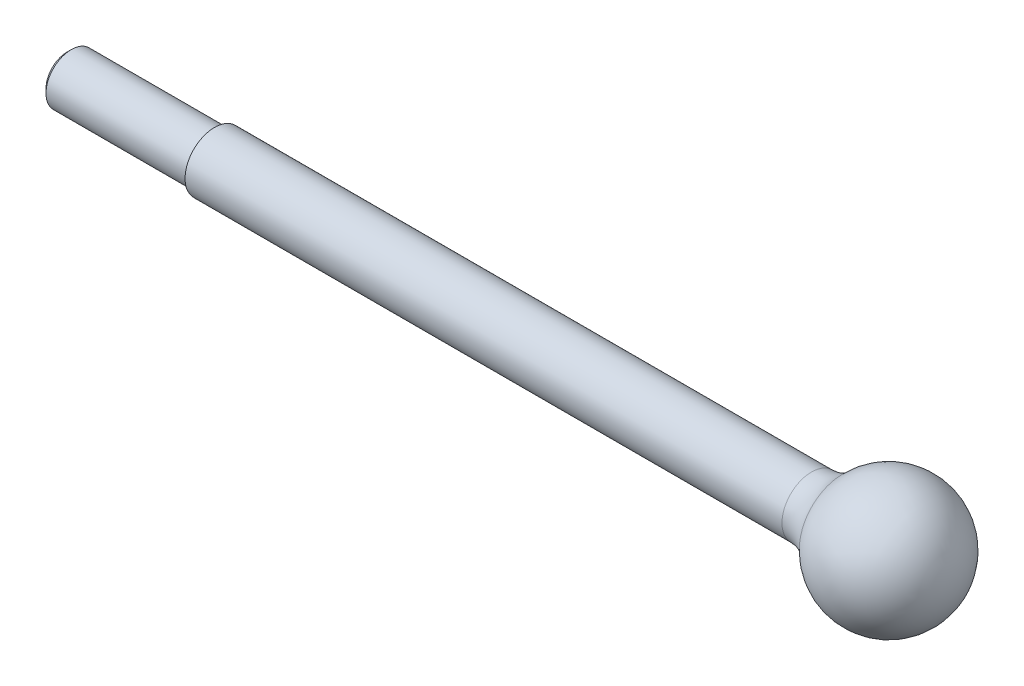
ISO-10303-21;
HEADER;
FILE_DESCRIPTION(('STEP AP214'),'2;1');
FILE_NAME('part.step','',(''),(''),'','','');
FILE_SCHEMA(('AUTOMOTIVE_DESIGN { 1 0 10303 214 1 1 1 1 }'));
ENDSEC;
DATA;
#1=APPLICATION_CONTEXT('core data for automotive mechanical design processes');
#2=APPLICATION_PROTOCOL_DEFINITION('international standard','automotive_design',2000,#1);
#3=PRODUCT_CONTEXT('',#1,'mechanical');
#4=PRODUCT('Part','Part','',(#3));
#5=PRODUCT_RELATED_PRODUCT_CATEGORY('part','',(#4));
#6=PRODUCT_DEFINITION_FORMATION('','',#4);
#7=PRODUCT_DEFINITION_CONTEXT('part definition',#1,'design');
#8=PRODUCT_DEFINITION('design','',#6,#7);
#9=PRODUCT_DEFINITION_SHAPE('','',#8);
#10=(LENGTH_UNIT() NAMED_UNIT(*) SI_UNIT(.MILLI.,.METRE.));
#11=(NAMED_UNIT(*) PLANE_ANGLE_UNIT() SI_UNIT($,.RADIAN.));
#12=(NAMED_UNIT(*) SI_UNIT($,.STERADIAN.) SOLID_ANGLE_UNIT());
#13=UNCERTAINTY_MEASURE_WITH_UNIT(LENGTH_MEASURE(1.E-05),#10,'distance_accuracy_value','');
#14=(GEOMETRIC_REPRESENTATION_CONTEXT(3) GLOBAL_UNCERTAINTY_ASSIGNED_CONTEXT((#13)) GLOBAL_UNIT_ASSIGNED_CONTEXT((#10,
#11,#12)) REPRESENTATION_CONTEXT('',''));
#15=CARTESIAN_POINT('',(0.,0.,0.));
#16=DIRECTION('',(0.,0.,1.));
#17=DIRECTION('',(1.,0.,0.));
#18=AXIS2_PLACEMENT_3D('',#15,#16,#17);
#19=CARTESIAN_POINT('',(0.,0.,0.));
#20=DIRECTION('',(1.,0.,0.));
#21=DIRECTION('',(0.,0.,1.));
#22=AXIS2_PLACEMENT_3D('',#19,#20,#21);
#23=SPHERICAL_SURFACE('',#22,15.);
#24=CARTESIAN_POINT('',(-10.998181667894,0.,0.));
#25=DIRECTION('',(1.,0.,0.));
#26=DIRECTION('',(0.,0.,-1.));
#27=AXIS2_PLACEMENT_3D('',#24,#25,#26);
#28=CIRCLE('',#27,10.2);
#29=CARTESIAN_POINT('',(-10.998181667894,0.,-10.2));
#30=VERTEX_POINT('',#29);
#31=EDGE_CURVE('E45',#30,#30,#28,.T.);
#32=ORIENTED_EDGE('',*,*,#31,.T.);
#33=EDGE_LOOP('',(#32));
#34=FACE_BOUND('',#33,.T.);
#35=ADVANCED_FACE('F30',(#34),#23,.T.);
#36=CARTESIAN_POINT('',(15.,0.,0.));
#37=DIRECTION('',(1.,0.,0.));
#38=DIRECTION('',(0.,0.,-1.));
#39=AXIS2_PLACEMENT_3D('',#36,#37,#38);
#40=CYLINDRICAL_SURFACE('',#39,6.99999999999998);
#41=CARTESIAN_POINT('',(-18.3303027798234,0.,0.));
#42=DIRECTION('',(1.,0.,0.));
#43=DIRECTION('',(0.,0.,-1.));
#44=AXIS2_PLACEMENT_3D('',#41,#42,#43);
#45=CIRCLE('',#44,6.99999999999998);
#46=CARTESIAN_POINT('',(-18.3303027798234,0.,-6.99999999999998));
#47=VERTEX_POINT('',#46);
#48=EDGE_CURVE('E41',#47,#47,#45,.F.);
#49=ORIENTED_EDGE('',*,*,#48,.T.);
#50=EDGE_LOOP('',(#49));
#51=FACE_BOUND('',#50,.T.);
#52=CARTESIAN_POINT('',(-160.,0.,0.));
#53=DIRECTION('',(1.,0.,0.));
#54=DIRECTION('',(0.,0.,-1.));
#55=AXIS2_PLACEMENT_3D('',#52,#53,#54);
#56=CIRCLE('',#55,6.99999999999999);
#57=CARTESIAN_POINT('',(-160.,0.,-6.99999999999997));
#58=VERTEX_POINT('',#57);
#59=EDGE_CURVE('E50',#58,#58,#56,.T.);
#60=ORIENTED_EDGE('',*,*,#59,.T.);
#61=EDGE_LOOP('',(#60));
#62=FACE_BOUND('',#61,.T.);
#63=ADVANCED_FACE('F70',(#51,#62),#40,.T.);
#64=CARTESIAN_POINT('',(-160.,0.,-5.99999999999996));
#65=DIRECTION('',(-1.,0.,0.));
#66=DIRECTION('',(0.,0.,1.));
#67=AXIS2_PLACEMENT_3D('',#64,#65,#66);
#68=PLANE('',#67);
#69=CARTESIAN_POINT('',(-160.,0.,0.));
#70=DIRECTION('',(1.,0.,0.));
#71=DIRECTION('',(0.,0.,-1.));
#72=AXIS2_PLACEMENT_3D('',#69,#70,#71);
#73=CIRCLE('',#72,5.99999999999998);
#74=CARTESIAN_POINT('',(-160.,0.,-5.99999999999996));
#75=VERTEX_POINT('',#74);
#76=EDGE_CURVE('E53',#75,#75,#73,.T.);
#77=ORIENTED_EDGE('',*,*,#76,.T.);
#78=EDGE_LOOP('',(#77));
#79=FACE_BOUND('',#78,.T.);
#80=ORIENTED_EDGE('',*,*,#59,.F.);
#81=EDGE_LOOP('',(#80));
#82=FACE_BOUND('',#81,.T.);
#83=ADVANCED_FACE('F57',(#79,#82),#68,.T.);
#84=CARTESIAN_POINT('',(15.,0.,0.));
#85=DIRECTION('',(1.,0.,0.));
#86=DIRECTION('',(0.,0.,-1.));
#87=AXIS2_PLACEMENT_3D('',#84,#85,#86);
#88=CYLINDRICAL_SURFACE('',#87,5.99999999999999);
#89=CARTESIAN_POINT('',(-194.,0.,0.));
#90=DIRECTION('',(-1.,0.,0.));
#91=DIRECTION('',(0.,0.,1.));
#92=AXIS2_PLACEMENT_3D('',#89,#90,#91);
#93=CIRCLE('',#92,5.99999999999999);
#94=CARTESIAN_POINT('',(-194.,0.,6.00000000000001));
#95=VERTEX_POINT('',#94);
#96=EDGE_CURVE('E37',#95,#95,#93,.F.);
#97=ORIENTED_EDGE('',*,*,#96,.T.);
#98=EDGE_LOOP('',(#97));
#99=FACE_BOUND('',#98,.T.);
#100=ORIENTED_EDGE('',*,*,#76,.F.);
#101=EDGE_LOOP('',(#100));
#102=FACE_BOUND('',#101,.T.);
#103=ADVANCED_FACE('F60',(#99,#102),#88,.T.);
#104=CARTESIAN_POINT('',(-195.,0.,0.));
#105=DIRECTION('',(-1.,0.,0.));
#106=DIRECTION('',(0.,0.,1.));
#107=AXIS2_PLACEMENT_3D('',#104,#105,#106);
#108=PLANE('',#107);
#109=CARTESIAN_POINT('',(-195.,0.,0.));
#110=DIRECTION('',(-1.,0.,0.));
#111=DIRECTION('',(0.,0.,1.));
#112=AXIS2_PLACEMENT_3D('',#109,#110,#111);
#113=CIRCLE('',#112,5.00000000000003);
#114=CARTESIAN_POINT('',(-195.,0.,5.00000000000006));
#115=VERTEX_POINT('',#114);
#116=EDGE_CURVE('E10',#115,#115,#113,.T.);
#117=ORIENTED_EDGE('',*,*,#116,.T.);
#118=EDGE_LOOP('',(#117));
#119=FACE_BOUND('',#118,.T.);
#120=ADVANCED_FACE('F62',(#119),#108,.T.);
#121=CARTESIAN_POINT('',(-18.3303027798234,0.,0.));
#122=DIRECTION('',(1.,0.,0.));
#123=DIRECTION('',(0.,0.,-1.));
#124=AXIS2_PLACEMENT_3D('',#121,#122,#123);
#125=TOROIDAL_SURFACE('',#124,17.,10.);
#126=ORIENTED_EDGE('',*,*,#48,.F.);
#127=EDGE_LOOP('',(#126));
#128=FACE_BOUND('',#127,.T.);
#129=ORIENTED_EDGE('',*,*,#31,.F.);
#130=EDGE_LOOP('',(#129));
#131=FACE_BOUND('',#130,.T.);
#132=ADVANCED_FACE('F68',(#128,#131),#125,.F.);
#133=CARTESIAN_POINT('',(-194.,0.,0.));
#134=DIRECTION('',(1.,0.,0.));
#135=DIRECTION('',(0.,0.,-1.));
#136=AXIS2_PLACEMENT_3D('',#133,#134,#135);
#137=CONICAL_SURFACE('',#136,5.99999999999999,0.785398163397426);
#138=ORIENTED_EDGE('',*,*,#116,.F.);
#139=EDGE_LOOP('',(#138));
#140=FACE_BOUND('',#139,.T.);
#141=ORIENTED_EDGE('',*,*,#96,.F.);
#142=EDGE_LOOP('',(#141));
#143=FACE_BOUND('',#142,.T.);
#144=ADVANCED_FACE('F32',(#140,#143),#137,.T.);
#145=CLOSED_SHELL('',(#35,#63,#83,#103,#120,#132,#144));
#146=MANIFOLD_SOLID_BREP('B2',#145);
#147=ADVANCED_BREP_SHAPE_REPRESENTATION('',(#18,#146),#14);
#148=SHAPE_DEFINITION_REPRESENTATION(#9,#147);
ENDSEC;
END-ISO-10303-21;
